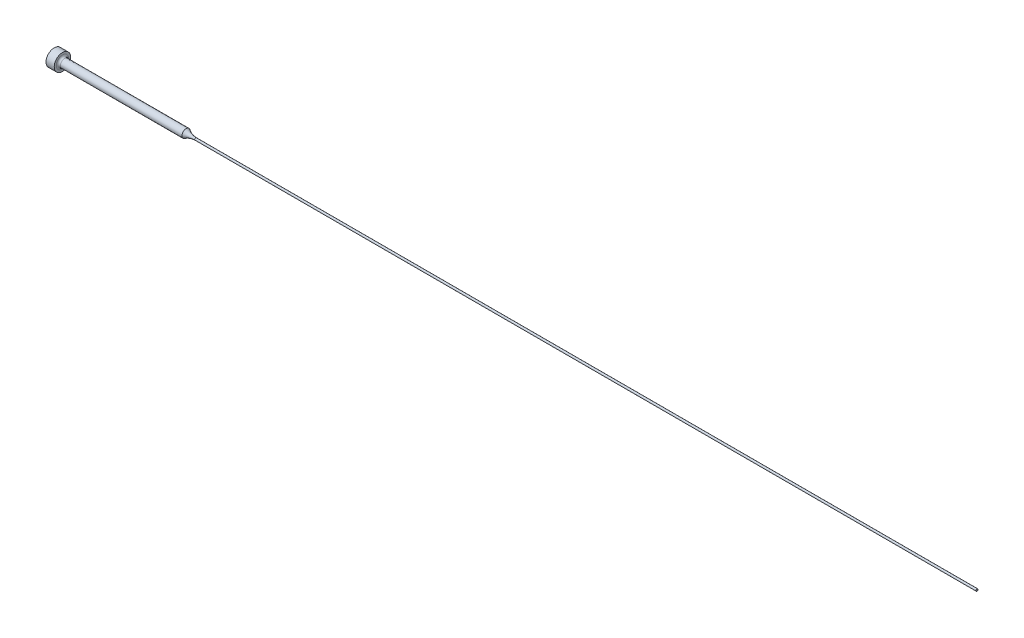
ISO-10303-21;
HEADER;
FILE_DESCRIPTION(('STEP AP214'),'2;1');
FILE_NAME('part.step','',(''),(''),'','','');
FILE_SCHEMA(('AUTOMOTIVE_DESIGN { 1 0 10303 214 1 1 1 1 }'));
ENDSEC;
DATA;
#1=APPLICATION_CONTEXT('core data for automotive mechanical design processes');
#2=APPLICATION_PROTOCOL_DEFINITION('international standard','automotive_design',2000,#1);
#3=PRODUCT_CONTEXT('',#1,'mechanical');
#4=PRODUCT('Part','Part','',(#3));
#5=PRODUCT_RELATED_PRODUCT_CATEGORY('part','',(#4));
#6=PRODUCT_DEFINITION_FORMATION('','',#4);
#7=PRODUCT_DEFINITION_CONTEXT('part definition',#1,'design');
#8=PRODUCT_DEFINITION('design','',#6,#7);
#9=PRODUCT_DEFINITION_SHAPE('','',#8);
#10=(LENGTH_UNIT() NAMED_UNIT(*) SI_UNIT(.MILLI.,.METRE.));
#11=(NAMED_UNIT(*) PLANE_ANGLE_UNIT() SI_UNIT($,.RADIAN.));
#12=(NAMED_UNIT(*) SI_UNIT($,.STERADIAN.) SOLID_ANGLE_UNIT());
#13=UNCERTAINTY_MEASURE_WITH_UNIT(LENGTH_MEASURE(1.E-05),#10,'distance_accuracy_value','');
#14=(GEOMETRIC_REPRESENTATION_CONTEXT(3) GLOBAL_UNCERTAINTY_ASSIGNED_CONTEXT((#13)) GLOBAL_UNIT_ASSIGNED_CONTEXT((#10,
#11,#12)) REPRESENTATION_CONTEXT('',''));
#15=CARTESIAN_POINT('',(0.,0.,0.));
#16=DIRECTION('',(0.,0.,1.));
#17=DIRECTION('',(1.,0.,0.));
#18=AXIS2_PLACEMENT_3D('',#15,#16,#17);
#19=CARTESIAN_POINT('',(355.6,0.389890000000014,0.));
#20=DIRECTION('',(-1.,0.,0.));
#21=DIRECTION('',(0.,-1.,0.));
#22=AXIS2_PLACEMENT_3D('',#19,#20,#21);
#23=PLANE('',#22);
#24=CARTESIAN_POINT('',(355.6,0.,0.));
#25=DIRECTION('',(-1.,0.,0.));
#26=DIRECTION('',(0.,-1.,0.));
#27=AXIS2_PLACEMENT_3D('',#24,#25,#26);
#28=CIRCLE('',#27,0.38989);
#29=CARTESIAN_POINT('',(355.6,-0.389889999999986,0.));
#30=VERTEX_POINT('',#29);
#31=EDGE_CURVE('E10',#30,#30,#28,.T.);
#32=ORIENTED_EDGE('',*,*,#31,.F.);
#33=EDGE_LOOP('',(#32));
#34=FACE_BOUND('',#33,.T.);
#35=ADVANCED_FACE('F29',(#34),#23,.F.);
#36=CARTESIAN_POINT('',(355.6,0.,0.));
#37=DIRECTION('',(-1.,0.,0.));
#38=DIRECTION('',(0.,-1.,0.));
#39=AXIS2_PLACEMENT_3D('',#36,#37,#38);
#40=CYLINDRICAL_SURFACE('',#39,0.389890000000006);
#41=CARTESIAN_POINT('',(54.5115195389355,0.,0.));
#42=DIRECTION('',(-1.,0.,0.));
#43=DIRECTION('',(0.,-1.,0.));
#44=AXIS2_PLACEMENT_3D('',#41,#42,#43);
#45=CIRCLE('',#44,0.389890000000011);
#46=CARTESIAN_POINT('',(54.5115195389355,-0.389890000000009,0.));
#47=VERTEX_POINT('',#46);
#48=EDGE_CURVE('E35',#47,#47,#45,.T.);
#49=ORIENTED_EDGE('',*,*,#48,.F.);
#50=EDGE_LOOP('',(#49));
#51=FACE_BOUND('',#50,.T.);
#52=ORIENTED_EDGE('',*,*,#31,.T.);
#53=EDGE_LOOP('',(#52));
#54=FACE_BOUND('',#53,.T.);
#55=ADVANCED_FACE('F86',(#51,#54),#40,.T.);
#56=CARTESIAN_POINT('',(54.5115195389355,0.,0.));
#57=DIRECTION('',(-1.,0.,0.));
#58=DIRECTION('',(0.,-1.,0.));
#59=AXIS2_PLACEMENT_3D('',#56,#57,#58);
#60=TOROIDAL_SURFACE('',#59,6.73989000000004,6.35000000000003);
#61=CARTESIAN_POINT('',(50.8,0.,0.));
#62=DIRECTION('',(-1.,0.,0.));
#63=DIRECTION('',(0.,-1.,0.));
#64=AXIS2_PLACEMENT_3D('',#61,#62,#63);
#65=CIRCLE('',#64,1.5875);
#66=CARTESIAN_POINT('',(50.8,-1.5875,0.));
#67=VERTEX_POINT('',#66);
#68=EDGE_CURVE('E39',#67,#67,#65,.T.);
#69=ORIENTED_EDGE('',*,*,#68,.F.);
#70=EDGE_LOOP('',(#69));
#71=FACE_BOUND('',#70,.T.);
#72=ORIENTED_EDGE('',*,*,#48,.T.);
#73=EDGE_LOOP('',(#72));
#74=FACE_BOUND('',#73,.T.);
#75=ADVANCED_FACE('F81',(#71,#74),#60,.F.);
#76=CARTESIAN_POINT('',(355.6,0.,0.));
#77=DIRECTION('',(-1.,0.,0.));
#78=DIRECTION('',(0.,-1.,0.));
#79=AXIS2_PLACEMENT_3D('',#76,#77,#78);
#80=CYLINDRICAL_SURFACE('',#79,1.5875);
#81=CARTESIAN_POINT('',(3.96875000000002,0.,0.));
#82=DIRECTION('',(-1.,0.,0.));
#83=DIRECTION('',(0.,-1.,0.));
#84=AXIS2_PLACEMENT_3D('',#81,#82,#83);
#85=CIRCLE('',#84,1.5875);
#86=CARTESIAN_POINT('',(3.96875000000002,-1.5875,0.));
#87=VERTEX_POINT('',#86);
#88=EDGE_CURVE('E43',#87,#87,#85,.T.);
#89=ORIENTED_EDGE('',*,*,#88,.F.);
#90=EDGE_LOOP('',(#89));
#91=FACE_BOUND('',#90,.T.);
#92=ORIENTED_EDGE('',*,*,#68,.T.);
#93=EDGE_LOOP('',(#92));
#94=FACE_BOUND('',#93,.T.);
#95=ADVANCED_FACE('F75',(#91,#94),#80,.T.);
#96=CARTESIAN_POINT('',(3.96875,0.,0.));
#97=DIRECTION('',(-1.,0.,0.));
#98=DIRECTION('',(0.,-1.,0.));
#99=AXIS2_PLACEMENT_3D('',#96,#97,#98);
#100=TOROIDAL_SURFACE('',#99,2.38125,0.79375);
#101=CARTESIAN_POINT('',(3.17499999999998,0.,0.));
#102=DIRECTION('',(-1.,0.,0.));
#103=DIRECTION('',(0.,-1.,0.));
#104=AXIS2_PLACEMENT_3D('',#101,#102,#103);
#105=CIRCLE('',#104,2.38125);
#106=CARTESIAN_POINT('',(3.17499999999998,-2.38125,0.));
#107=VERTEX_POINT('',#106);
#108=EDGE_CURVE('E48',#107,#107,#105,.T.);
#109=ORIENTED_EDGE('',*,*,#108,.F.);
#110=EDGE_LOOP('',(#109));
#111=FACE_BOUND('',#110,.T.);
#112=ORIENTED_EDGE('',*,*,#88,.T.);
#113=EDGE_LOOP('',(#112));
#114=FACE_BOUND('',#113,.T.);
#115=ADVANCED_FACE('F69',(#111,#114),#100,.F.);
#116=CARTESIAN_POINT('',(3.175,3.175,0.));
#117=DIRECTION('',(-1.,0.,0.));
#118=DIRECTION('',(0.,-1.,0.));
#119=AXIS2_PLACEMENT_3D('',#116,#117,#118);
#120=PLANE('',#119);
#121=CARTESIAN_POINT('',(3.17499999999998,0.,0.));
#122=DIRECTION('',(-1.,0.,0.));
#123=DIRECTION('',(0.,-1.,0.));
#124=AXIS2_PLACEMENT_3D('',#121,#122,#123);
#125=CIRCLE('',#124,3.175);
#126=CARTESIAN_POINT('',(3.17499999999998,-3.175,0.));
#127=VERTEX_POINT('',#126);
#128=EDGE_CURVE('E51',#127,#127,#125,.T.);
#129=ORIENTED_EDGE('',*,*,#128,.F.);
#130=EDGE_LOOP('',(#129));
#131=FACE_BOUND('',#130,.T.);
#132=ORIENTED_EDGE('',*,*,#108,.T.);
#133=EDGE_LOOP('',(#132));
#134=FACE_BOUND('',#133,.T.);
#135=ADVANCED_FACE('F63',(#131,#134),#120,.F.);
#136=CARTESIAN_POINT('',(355.6,0.,0.));
#137=DIRECTION('',(-1.,0.,0.));
#138=DIRECTION('',(0.,-1.,0.));
#139=AXIS2_PLACEMENT_3D('',#136,#137,#138);
#140=CYLINDRICAL_SURFACE('',#139,3.175);
#141=CARTESIAN_POINT('',(0.,0.,0.));
#142=DIRECTION('',(-1.,0.,0.));
#143=DIRECTION('',(0.,-1.,0.));
#144=AXIS2_PLACEMENT_3D('',#141,#142,#143);
#145=CIRCLE('',#144,3.175);
#146=CARTESIAN_POINT('',(0.,-3.175,0.));
#147=VERTEX_POINT('',#146);
#148=EDGE_CURVE('E54',#147,#147,#145,.T.);
#149=ORIENTED_EDGE('',*,*,#148,.F.);
#150=EDGE_LOOP('',(#149));
#151=FACE_BOUND('',#150,.T.);
#152=ORIENTED_EDGE('',*,*,#128,.T.);
#153=EDGE_LOOP('',(#152));
#154=FACE_BOUND('',#153,.T.);
#155=ADVANCED_FACE('F60',(#151,#154),#140,.T.);
#156=CARTESIAN_POINT('',(0.,0.,0.));
#157=DIRECTION('',(1.,0.,0.));
#158=DIRECTION('',(0.,1.,0.));
#159=AXIS2_PLACEMENT_3D('',#156,#157,#158);
#160=PLANE('',#159);
#161=ORIENTED_EDGE('',*,*,#148,.T.);
#162=EDGE_LOOP('',(#161));
#163=FACE_BOUND('',#162,.T.);
#164=ADVANCED_FACE('F58',(#163),#160,.F.);
#165=CLOSED_SHELL('',(#35,#55,#75,#95,#115,#135,#155,#164));
#166=MANIFOLD_SOLID_BREP('B2',#165);
#167=ADVANCED_BREP_SHAPE_REPRESENTATION('',(#18,#166),#14);
#168=SHAPE_DEFINITION_REPRESENTATION(#9,#167);
ENDSEC;
END-ISO-10303-21;
